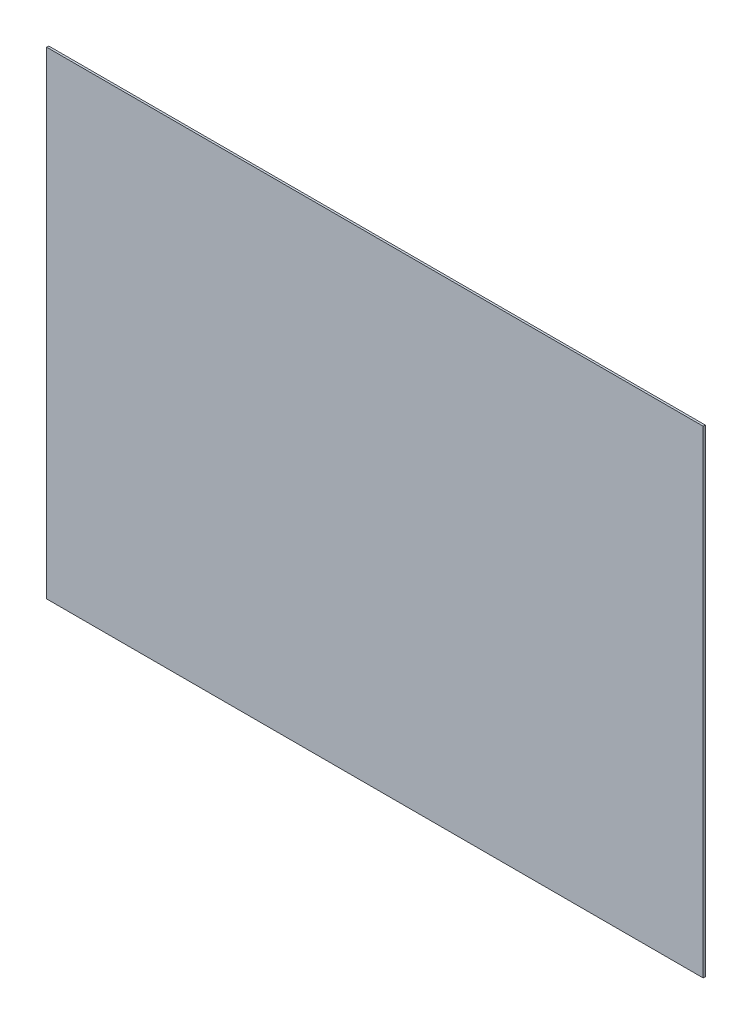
from build123d import *

# Parameters (mm, degrees)
MODEL_W                 = 158.99999996
MODEL_H                 = 114.999999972
BOSS_EXTRU_1_DEPTH      = 0.5
ESQUISSE1_W             = 7.736861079
ESQUISSE1_H             = 120.594117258
ENL_V_MAT_EXTRU_1_DEPTH = 1352.488805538


with BuildPart() as part:
    # Model → Boss.-Extru.1 (new body)
    with BuildSketch(Plane.XY):
        with Locations((1222.563579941, 304.64938264)):
            Rectangle(MODEL_W, MODEL_H)
    extrude(amount=BOSS_EXTRU_1_DEPTH)

    # Esquisse1 → Enl_v. mat.-Extru.1 (cut, through all)
    with BuildSketch(Plane.XY.offset(0.5)):
        with Locations((1140.195149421, 305.06986422)):
            Rectangle(ESQUISSE1_W, ESQUISSE1_H)
    extrude(amount=-ENL_V_MAT_EXTRU_1_DEPTH, mode=Mode.SUBTRACT)


solid = part.part
